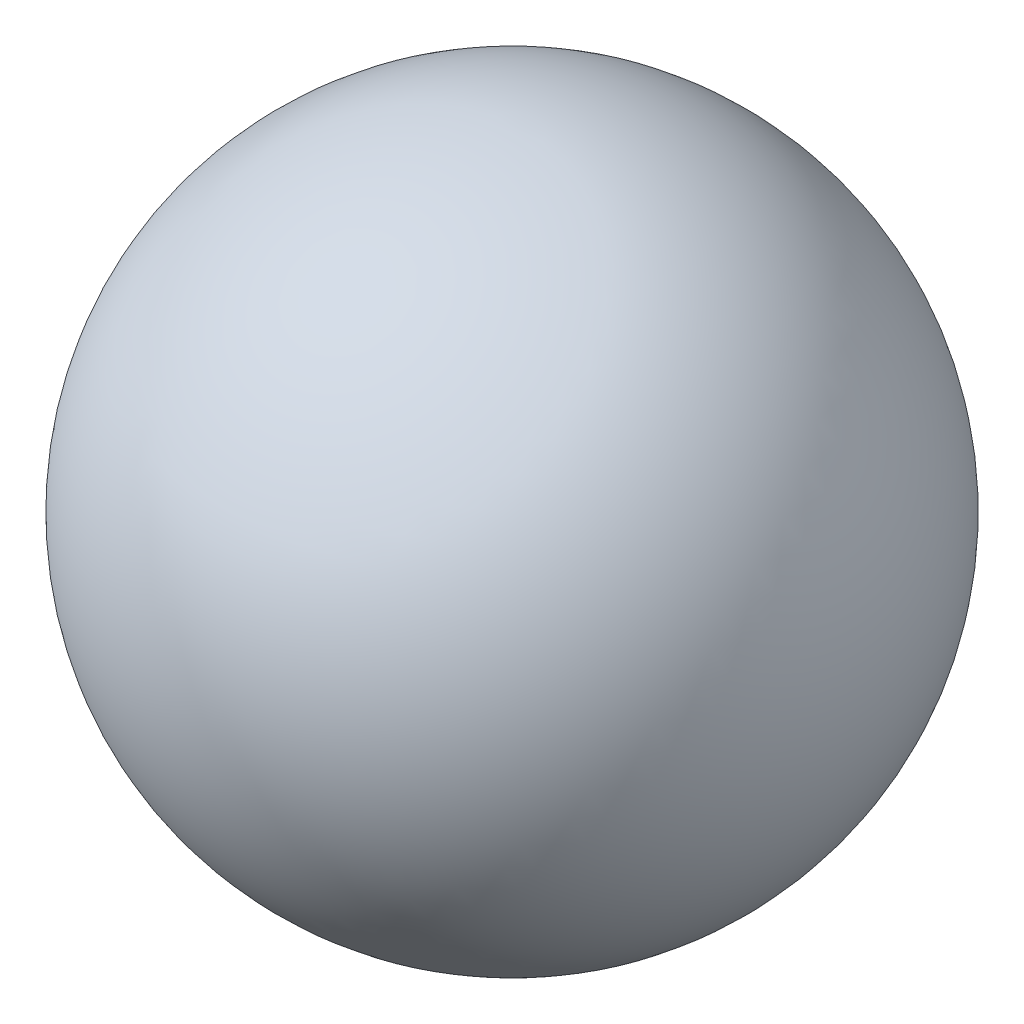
ISO-10303-21;
HEADER;
FILE_DESCRIPTION(('STEP AP214'),'2;1');
FILE_NAME('part.step','',(''),(''),'','','');
FILE_SCHEMA(('AUTOMOTIVE_DESIGN { 1 0 10303 214 1 1 1 1 }'));
ENDSEC;
DATA;
#1=APPLICATION_CONTEXT('core data for automotive mechanical design processes');
#2=APPLICATION_PROTOCOL_DEFINITION('international standard','automotive_design',2000,#1);
#3=PRODUCT_CONTEXT('',#1,'mechanical');
#4=PRODUCT('Part','Part','',(#3));
#5=PRODUCT_RELATED_PRODUCT_CATEGORY('part','',(#4));
#6=PRODUCT_DEFINITION_FORMATION('','',#4);
#7=PRODUCT_DEFINITION_CONTEXT('part definition',#1,'design');
#8=PRODUCT_DEFINITION('design','',#6,#7);
#9=PRODUCT_DEFINITION_SHAPE('','',#8);
#10=(LENGTH_UNIT() NAMED_UNIT(*) SI_UNIT(.MILLI.,.METRE.));
#11=(NAMED_UNIT(*) PLANE_ANGLE_UNIT() SI_UNIT($,.RADIAN.));
#12=(NAMED_UNIT(*) SI_UNIT($,.STERADIAN.) SOLID_ANGLE_UNIT());
#13=UNCERTAINTY_MEASURE_WITH_UNIT(LENGTH_MEASURE(1.E-05),#10,'distance_accuracy_value','');
#14=(GEOMETRIC_REPRESENTATION_CONTEXT(3) GLOBAL_UNCERTAINTY_ASSIGNED_CONTEXT((#13)) GLOBAL_UNIT_ASSIGNED_CONTEXT((#10,
#11,#12)) REPRESENTATION_CONTEXT('',''));
#15=CARTESIAN_POINT('',(0.,0.,0.));
#16=DIRECTION('',(0.,0.,1.));
#17=DIRECTION('',(1.,0.,0.));
#18=AXIS2_PLACEMENT_3D('',#15,#16,#17);
#19=CARTESIAN_POINT('',(0.,0.,0.));
#20=DIRECTION('',(0.,1.,0.));
#21=DIRECTION('',(1.,0.,0.));
#22=AXIS2_PLACEMENT_3D('',#19,#20,#21);
#23=SPHERICAL_SURFACE('',#22,9.652);
#24=CARTESIAN_POINT('',(0.,9.652,0.));
#25=VERTEX_POINT('',#24);
#26=VERTEX_LOOP('',#25);
#27=FACE_BOUND('',#26,.T.);
#28=ADVANCED_FACE('F39',(#27),#23,.T.);
#29=CLOSED_SHELL('',(#28));
#30=MANIFOLD_SOLID_BREP('B2',#29);
#31=ADVANCED_BREP_SHAPE_REPRESENTATION('',(#18,#30),#14);
#32=SHAPE_DEFINITION_REPRESENTATION(#9,#31);
ENDSEC;
END-ISO-10303-21;
